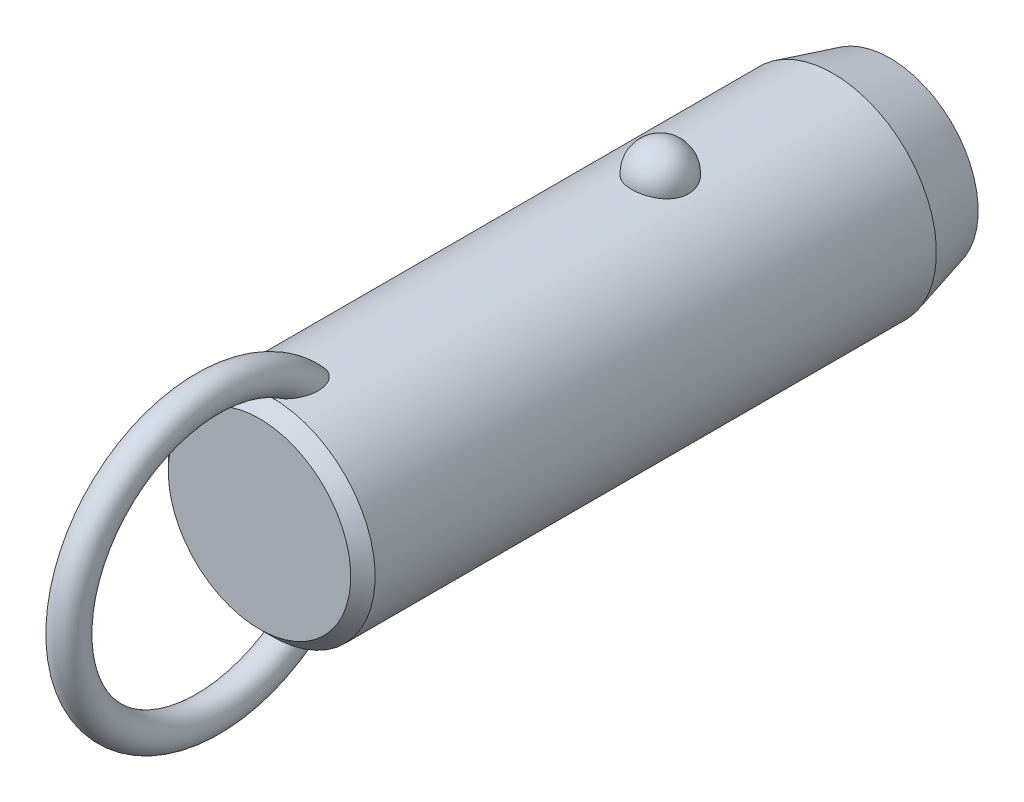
ISO-10303-21;
HEADER;
FILE_DESCRIPTION(('STEP AP214'),'2;1');
FILE_NAME('part.step','',(''),(''),'','','');
FILE_SCHEMA(('AUTOMOTIVE_DESIGN { 1 0 10303 214 1 1 1 1 }'));
ENDSEC;
DATA;
#1=APPLICATION_CONTEXT('core data for automotive mechanical design processes');
#2=APPLICATION_PROTOCOL_DEFINITION('international standard','automotive_design',2000,#1);
#3=PRODUCT_CONTEXT('',#1,'mechanical');
#4=PRODUCT('Part','Part','',(#3));
#5=PRODUCT_RELATED_PRODUCT_CATEGORY('part','',(#4));
#6=PRODUCT_DEFINITION_FORMATION('','',#4);
#7=PRODUCT_DEFINITION_CONTEXT('part definition',#1,'design');
#8=PRODUCT_DEFINITION('design','',#6,#7);
#9=PRODUCT_DEFINITION_SHAPE('','',#8);
#10=(LENGTH_UNIT() NAMED_UNIT(*) SI_UNIT(.MILLI.,.METRE.));
#11=(NAMED_UNIT(*) PLANE_ANGLE_UNIT() SI_UNIT($,.RADIAN.));
#12=(NAMED_UNIT(*) SI_UNIT($,.STERADIAN.) SOLID_ANGLE_UNIT());
#13=UNCERTAINTY_MEASURE_WITH_UNIT(LENGTH_MEASURE(1.E-05),#10,'distance_accuracy_value','');
#14=(GEOMETRIC_REPRESENTATION_CONTEXT(3) GLOBAL_UNCERTAINTY_ASSIGNED_CONTEXT((#13)) GLOBAL_UNIT_ASSIGNED_CONTEXT((#10,
#11,#12)) REPRESENTATION_CONTEXT('',''));
#15=CARTESIAN_POINT('',(0.,0.,0.));
#16=DIRECTION('',(0.,0.,1.));
#17=DIRECTION('',(1.,0.,0.));
#18=AXIS2_PLACEMENT_3D('',#15,#16,#17);
#19=CARTESIAN_POINT('',(0.,0.,33.));
#20=DIRECTION('',(0.,0.,-1.));
#21=DIRECTION('',(-1.,0.,0.));
#22=AXIS2_PLACEMENT_3D('',#19,#20,#21);
#23=CYLINDRICAL_SURFACE('',#22,12.7);
#24=CARTESIAN_POINT('',(3.46661256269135,12.2177165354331,-3.5));
#25=CARTESIAN_POINT('',(3.4666090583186,12.2177194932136,-3.30432790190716));
#26=CARTESIAN_POINT('',(3.45063567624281,12.2222841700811,-3.10861112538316));
#27=CARTESIAN_POINT('',(3.38712451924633,12.2400345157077,-2.72271899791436));
#28=CARTESIAN_POINT('',(3.33957415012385,12.2532236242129,-2.53254588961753));
#29=CARTESIAN_POINT('',(3.2141234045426,12.286724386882,-2.16324948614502));
#30=CARTESIAN_POINT('',(3.13623639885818,12.3070329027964,-1.98412136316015));
#31=CARTESIAN_POINT('',(2.95205930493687,12.3525018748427,-1.64180592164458));
#32=CARTESIAN_POINT('',(2.84577003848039,12.3776621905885,-1.47861814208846));
#33=CARTESIAN_POINT('',(2.60688050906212,12.4301712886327,-1.17190583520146));
#34=CARTESIAN_POINT('',(2.47415697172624,12.4575299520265,-1.02847897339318));
#35=CARTESIAN_POINT('',(2.18615174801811,12.5112810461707,-0.76617774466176));
#36=CARTESIAN_POINT('',(2.03087002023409,12.5376734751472,-0.647303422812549));
#37=CARTESIAN_POINT('',(1.70237334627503,12.5864761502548,-0.437732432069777));
#38=CARTESIAN_POINT('',(1.52920948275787,12.6088972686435,-0.346958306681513));
#39=CARTESIAN_POINT('',(1.16944170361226,12.6473352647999,-0.195750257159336));
#40=CARTESIAN_POINT('',(0.982839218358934,12.663352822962,-0.13531310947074));
#41=CARTESIAN_POINT('',(0.604961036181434,12.6869706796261,-0.0473241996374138));
#42=CARTESIAN_POINT('',(0.41382314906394,12.6947125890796,-0.0192185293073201));
#43=CARTESIAN_POINT('',(0.0293827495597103,12.7014203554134,0.00517254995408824));
#44=CARTESIAN_POINT('',(-0.163919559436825,12.7003870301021,0.00146092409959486));
#45=CARTESIAN_POINT('',(-0.544374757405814,12.689735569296,-0.037393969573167));
#46=CARTESIAN_POINT('',(-0.731575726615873,12.6802364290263,-0.072101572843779));
#47=CARTESIAN_POINT('',(-1.09733277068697,12.6538333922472,-0.171364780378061));
#48=CARTESIAN_POINT('',(-1.27588869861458,12.6369293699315,-0.235920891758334));
#49=CARTESIAN_POINT('',(-1.6204698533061,12.5973946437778,-0.393548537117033));
#50=CARTESIAN_POINT('',(-1.78641865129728,12.5747321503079,-0.486778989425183));
#51=CARTESIAN_POINT('',(-2.10030671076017,12.5261316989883,-0.699110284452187));
#52=CARTESIAN_POINT('',(-2.24824419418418,12.5001934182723,-0.818213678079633));
#53=CARTESIAN_POINT('',(-2.52491489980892,12.4472906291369,-1.08157124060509));
#54=CARTESIAN_POINT('',(-2.65324222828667,12.4203160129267,-1.22624992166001));
#55=CARTESIAN_POINT('',(-2.88410007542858,12.3687509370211,-1.53528325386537));
#56=CARTESIAN_POINT('',(-2.98662883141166,12.3441606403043,-1.69963924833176));
#57=CARTESIAN_POINT('',(-3.16432417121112,12.2998199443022,-2.04548497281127));
#58=CARTESIAN_POINT('',(-3.23917525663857,12.2801261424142,-2.22714424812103));
#59=CARTESIAN_POINT('',(-3.35800573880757,12.248167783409,-2.6009138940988));
#60=CARTESIAN_POINT('',(-3.4019860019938,12.2359030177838,-2.79302397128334));
#61=CARTESIAN_POINT('',(-3.45784812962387,12.2202347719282,-3.18140279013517));
#62=CARTESIAN_POINT('',(-3.46986123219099,12.2167950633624,-3.37765118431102));
#63=CARTESIAN_POINT('',(-3.46186273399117,12.2190638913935,-3.76943689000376));
#64=CARTESIAN_POINT('',(-3.44185196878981,12.2247721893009,-3.96497421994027));
#65=CARTESIAN_POINT('',(-3.37048652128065,12.2446381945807,-4.34881728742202));
#66=CARTESIAN_POINT('',(-3.31928253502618,12.2587552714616,-4.53715319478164));
#67=CARTESIAN_POINT('',(-3.18693461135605,12.2938237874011,-4.90231727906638));
#68=CARTESIAN_POINT('',(-3.1057895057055,12.3147754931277,-5.07914500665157));
#69=CARTESIAN_POINT('',(-2.91506431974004,12.3613125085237,-5.41732059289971));
#70=CARTESIAN_POINT('',(-2.80533587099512,12.3869217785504,-5.57858147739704));
#71=CARTESIAN_POINT('',(-2.560414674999,12.4398525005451,-5.88013283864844));
#72=CARTESIAN_POINT('',(-2.42522099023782,12.4671740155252,-6.02042254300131));
#73=CARTESIAN_POINT('',(-2.1323357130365,12.5205965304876,-6.27662798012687));
#74=CARTESIAN_POINT('',(-1.97456596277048,12.5466928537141,-6.3924554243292));
#75=CARTESIAN_POINT('',(-1.64115839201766,12.5946384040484,-6.59583547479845));
#76=CARTESIAN_POINT('',(-1.46552179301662,12.6164879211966,-6.68339001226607));
#77=CARTESIAN_POINT('',(-1.10356050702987,12.6532533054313,-6.82682153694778));
#78=CARTESIAN_POINT('',(-0.9173913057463,12.6682500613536,-6.8830698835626));
#79=CARTESIAN_POINT('',(-0.537836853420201,12.6900288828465,-6.96386887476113));
#80=CARTESIAN_POINT('',(-0.344452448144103,12.6968119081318,-6.9884232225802));
#81=CARTESIAN_POINT('',(0.0402577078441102,12.7013667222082,-7.00496469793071));
#82=CARTESIAN_POINT('',(0.231556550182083,12.6993008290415,-6.99753844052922));
#83=CARTESIAN_POINT('',(0.610105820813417,12.6867505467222,-6.9516636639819));
#84=CARTESIAN_POINT('',(0.797356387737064,12.6762664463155,-6.91321620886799));
#85=CARTESIAN_POINT('',(1.16186657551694,12.6480587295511,-6.80658431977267));
#86=CARTESIAN_POINT('',(1.33915951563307,12.6303611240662,-6.73850666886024));
#87=CARTESIAN_POINT('',(1.67968518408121,12.5896027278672,-6.57450875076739));
#88=CARTESIAN_POINT('',(1.84291705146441,12.5665416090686,-6.47858678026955));
#89=CARTESIAN_POINT('',(2.15340192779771,12.5171072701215,-6.25982455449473));
#90=CARTESIAN_POINT('',(2.30037831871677,12.4906895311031,-6.13660186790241));
#91=CARTESIAN_POINT('',(2.5717412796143,12.4376567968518,-5.86739587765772));
#92=CARTESIAN_POINT('',(2.69612388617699,12.4110417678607,-5.72140858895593));
#93=CARTESIAN_POINT('',(2.92107785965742,12.360051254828,-5.40794137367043));
#94=CARTESIAN_POINT('',(3.02121329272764,12.3357209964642,-5.24014110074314));
#95=CARTESIAN_POINT('',(3.19236291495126,12.2925446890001,-4.8896986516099));
#96=CARTESIAN_POINT('',(3.26338839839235,12.2736965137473,-4.70706226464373));
#97=CARTESIAN_POINT('',(3.36788038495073,12.245404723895,-4.35469510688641));
#98=CARTESIAN_POINT('',(3.40484026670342,12.2351018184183,-4.18605935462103));
#99=CARTESIAN_POINT('',(3.45420764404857,12.2212564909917,-3.84496058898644));
#100=CARTESIAN_POINT('',(3.46661565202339,12.2177139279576,-3.67249765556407));
#101=CARTESIAN_POINT('',(3.46661256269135,12.2177165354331,-3.5));
#102=B_SPLINE_CURVE_WITH_KNOTS('',3,(#24,#25,#26,#27,#28,#29,#30,#31,#32,#33,#34,#35,#36,#37,
#38,#39,#40,#41,#42,#43,#44,#45,#46,#47,#48,#49,#50,#51,#52,#53,#54,#55,#56,#57,#58,#59,#60,#61,
#62,#63,#64,#65,#66,#67,#68,#69,#70,#71,#72,#73,#74,#75,#76,#77,#78,#79,#80,#81,#82,#83,#84,#85,
#86,#87,#88,#89,#90,#91,#92,#93,#94,#95,#96,#97,#98,#99,#100,#101),.UNSPECIFIED.,.T.,.F.,(4,2,2,
2,2,2,2,2,2,2,2,2,2,2,2,2,2,2,2,2,2,2,2,2,2,2,2,2,2,2,2,2,2,2,2,2,2,2,4),(0.,0.586396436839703,
1.17302689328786,1.7593990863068,2.34575431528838,2.93491084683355,3.52406845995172,
4.11158733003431,4.69904375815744,5.2762784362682,5.85345931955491,6.42265312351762,
6.99185659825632,7.56427334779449,8.136746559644,8.71981013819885,9.3029135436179,
9.89247258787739,10.4820150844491,11.0691335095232,11.6562366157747,12.2405256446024,
12.8248374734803,13.412244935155,13.9996740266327,14.5891883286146,15.1786623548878,
15.7609861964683,16.3432419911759,16.9148635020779,17.4864654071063,18.0560241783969,
18.6256177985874,19.2037609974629,19.7820055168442,20.3699810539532,20.957728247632,
21.4746855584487,21.9916320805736),.UNSPECIFIED.);
#103=CARTESIAN_POINT('',(3.46661256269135,12.2177165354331,-3.5));
#104=VERTEX_POINT('',#103);
#105=EDGE_CURVE('E41',#104,#104,#102,.T.);
#106=ORIENTED_EDGE('',*,*,#105,.T.);
#107=EDGE_LOOP('',(#106));
#108=FACE_BOUND('',#107,.T.);
#109=CARTESIAN_POINT('',(0.,0.,44.2));
#110=DIRECTION('',(0.,0.,1.));
#111=DIRECTION('',(1.,0.,0.));
#112=AXIS2_PLACEMENT_3D('',#109,#110,#111);
#113=CIRCLE('',#112,12.7);
#114=CARTESIAN_POINT('',(-12.7,0.,44.2));
#115=VERTEX_POINT('',#114);
#116=EDGE_CURVE('E10',#115,#115,#113,.F.);
#117=ORIENTED_EDGE('',*,*,#116,.T.);
#118=EDGE_LOOP('',(#117));
#119=FACE_BOUND('',#118,.T.);
#120=CARTESIAN_POINT('',(-0.54812224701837,-12.6881662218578,37.9432187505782));
#121=CARTESIAN_POINT('',(-0.648865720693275,-12.6838128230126,37.977926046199));
#122=CARTESIAN_POINT('',(-0.746398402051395,-12.6783867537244,38.0220428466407));
#123=CARTESIAN_POINT('',(-0.932125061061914,-12.666091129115,38.1267647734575));
#124=CARTESIAN_POINT('',(-1.02030388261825,-12.6592192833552,38.1873961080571));
#125=CARTESIAN_POINT('',(-1.18487740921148,-12.6448747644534,38.321847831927));
#126=CARTESIAN_POINT('',(-1.26134296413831,-12.637406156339,38.3955825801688));
#127=CARTESIAN_POINT('',(-1.4023120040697,-12.6225412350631,38.5536045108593));
#128=CARTESIAN_POINT('',(-1.46681470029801,-12.6151449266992,38.6378923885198));
#129=CARTESIAN_POINT('',(-1.60714786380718,-12.5981718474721,38.8496577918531));
#130=CARTESIAN_POINT('',(-1.67725126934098,-12.588900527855,38.980962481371));
#131=CARTESIAN_POINT('',(-1.79536591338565,-12.5725964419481,39.2532471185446));
#132=CARTESIAN_POINT('',(-1.84333535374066,-12.5655679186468,39.3942447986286));
#133=CARTESIAN_POINT('',(-1.93422576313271,-12.5519624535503,39.7376455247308));
#134=CARTESIAN_POINT('',(-1.96788773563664,-12.5466298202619,39.9425578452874));
#135=CARTESIAN_POINT('',(-1.9941399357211,-12.542463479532,40.2517600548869));
#136=CARTESIAN_POINT('',(-1.99883864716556,-12.5417153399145,40.3552987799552));
#137=CARTESIAN_POINT('',(-2.00078003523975,-12.5414074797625,40.5624512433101));
#138=CARTESIAN_POINT('',(-1.99802449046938,-12.5418474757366,40.6660649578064));
#139=CARTESIAN_POINT('',(-1.98336733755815,-12.5441750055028,40.9103207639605));
#140=CARTESIAN_POINT('',(-1.96851430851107,-12.5465291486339,41.050780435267));
#141=CARTESIAN_POINT('',(-1.92707089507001,-12.5529612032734,41.3299607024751));
#142=CARTESIAN_POINT('',(-1.900474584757,-12.5570399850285,41.4686803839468));
#143=CARTESIAN_POINT('',(-1.83619120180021,-12.5666008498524,41.7434113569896));
#144=CARTESIAN_POINT('',(-1.79850828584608,-12.57208240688,41.8794236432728));
#145=CARTESIAN_POINT('',(-1.71223796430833,-12.5841228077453,42.1478421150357));
#146=CARTESIAN_POINT('',(-1.66365679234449,-12.5906810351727,42.2802503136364));
#147=CARTESIAN_POINT('',(-1.57804503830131,-12.6016176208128,42.4854887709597));
#148=CARTESIAN_POINT('',(-1.54477252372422,-12.6057501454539,42.5599149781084));
#149=CARTESIAN_POINT('',(-1.47424480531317,-12.6141930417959,42.7068393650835));
#150=CARTESIAN_POINT('',(-1.43699041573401,-12.6185033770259,42.7793379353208));
#151=CARTESIAN_POINT('',(-1.35825795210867,-12.6272207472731,42.9218926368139));
#152=CARTESIAN_POINT('',(-1.31678520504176,-12.6316276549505,42.9919517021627));
#153=CARTESIAN_POINT('',(-1.22917793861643,-12.6404532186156,43.1290705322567));
#154=CARTESIAN_POINT('',(-1.18304514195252,-12.6448718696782,43.1961313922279));
#155=CARTESIAN_POINT('',(-1.07246411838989,-12.6547893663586,43.3438741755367));
#156=CARTESIAN_POINT('',(-1.00642239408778,-12.6602600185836,43.4233844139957));
#157=CARTESIAN_POINT('',(-0.864441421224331,-12.6707460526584,43.5731698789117));
#158=CARTESIAN_POINT('',(-0.788516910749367,-12.6757620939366,43.6434585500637));
#159=CARTESIAN_POINT('',(-0.652215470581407,-12.6833591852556,43.7486801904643));
#160=CARTESIAN_POINT('',(-0.594982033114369,-12.6861973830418,43.7876241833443));
#161=CARTESIAN_POINT('',(-0.475269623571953,-12.6912445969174,43.8564899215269));
#162=CARTESIAN_POINT('',(-0.412800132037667,-12.6934547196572,43.8864275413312));
#163=CARTESIAN_POINT('',(-0.295749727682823,-12.6966636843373,43.9297565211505));
#164=CARTESIAN_POINT('',(-0.241949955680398,-12.6978134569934,43.9452188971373));
#165=CARTESIAN_POINT('',(-0.132508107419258,-12.6994261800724,43.9668845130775));
#166=CARTESIAN_POINT('',(-0.0768679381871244,-12.6998898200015,43.9730970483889));
#167=CARTESIAN_POINT('',(0.0347696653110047,-12.7000752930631,43.9755838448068));
#168=CARTESIAN_POINT('',(0.0907676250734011,-12.6997954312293,43.9718353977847));
#169=CARTESIAN_POINT('',(0.201283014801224,-12.6985255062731,43.9547883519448));
#170=CARTESIAN_POINT('',(0.255799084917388,-12.6975348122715,43.9414812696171));
#171=CARTESIAN_POINT('',(0.376042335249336,-12.6946091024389,43.9020379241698));
#172=CARTESIAN_POINT('',(0.440950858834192,-12.6924943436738,43.8734492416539));
#173=CARTESIAN_POINT('',(0.565350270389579,-12.6875639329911,43.8063234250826));
#174=CARTESIAN_POINT('',(0.624828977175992,-12.6847467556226,43.7677646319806));
#175=CARTESIAN_POINT('',(0.774116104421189,-12.6767252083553,43.656949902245));
#176=CARTESIAN_POINT('',(0.859449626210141,-12.6711344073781,43.5787605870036));
#177=CARTESIAN_POINT('',(1.01789440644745,-12.6593922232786,43.410943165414));
#178=CARTESIAN_POINT('',(1.09096902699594,-12.653239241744,43.321282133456));
#179=CARTESIAN_POINT('',(1.22268793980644,-12.6411674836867,43.1402658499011));
#180=CARTESIAN_POINT('',(1.28193986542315,-12.6352572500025,43.049345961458));
#181=CARTESIAN_POINT('',(1.39259777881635,-12.6235401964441,42.8627929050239));
#182=CARTESIAN_POINT('',(1.44399707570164,-12.6177334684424,42.7671558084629));
#183=CARTESIAN_POINT('',(1.53972870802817,-12.6064093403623,42.5722738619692));
#184=CARTESIAN_POINT('',(1.58405262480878,-12.6008922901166,42.4730248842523));
#185=CARTESIAN_POINT('',(1.66600705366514,-12.5903187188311,42.2717727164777));
#186=CARTESIAN_POINT('',(1.70363651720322,-12.5852622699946,42.1697690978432));
#187=CARTESIAN_POINT('',(1.7754537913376,-12.5753406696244,41.9543580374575));
#188=CARTESIAN_POINT('',(1.80903453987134,-12.5705328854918,41.8407454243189));
#189=CARTESIAN_POINT('',(1.86844163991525,-12.5618400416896,41.6114575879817));
#190=CARTESIAN_POINT('',(1.89426665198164,-12.5579551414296,41.4957820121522));
#191=CARTESIAN_POINT('',(1.93785464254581,-12.5513030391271,41.2630072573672));
#192=CARTESIAN_POINT('',(1.95562640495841,-12.5485346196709,41.1459097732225));
#193=CARTESIAN_POINT('',(1.98264463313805,-12.5442934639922,40.9107473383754));
#194=CARTESIAN_POINT('',(1.99189298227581,-12.5428204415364,40.7926826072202));
#195=CARTESIAN_POINT('',(2.00416068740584,-12.540871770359,40.4806225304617));
#196=CARTESIAN_POINT('',(1.99944433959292,-12.541631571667,40.286229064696));
#197=CARTESIAN_POINT('',(1.96113755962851,-12.5476846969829,39.9003095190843));
#198=CARTESIAN_POINT('',(1.92758341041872,-12.5529723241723,39.7087801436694));
#199=CARTESIAN_POINT('',(1.83934342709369,-12.5661532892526,39.3822728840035));
#200=CARTESIAN_POINT('',(1.79215440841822,-12.5730485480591,39.2452499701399));
#201=CARTESIAN_POINT('',(1.67676242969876,-12.588958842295,38.9804459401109));
#202=CARTESIAN_POINT('',(1.60859050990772,-12.597970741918,38.8526515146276));
#203=CARTESIAN_POINT('',(1.4658383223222,-12.6152829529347,38.6358006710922));
#204=CARTESIAN_POINT('',(1.39525727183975,-12.6233659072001,38.5441050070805));
#205=CARTESIAN_POINT('',(1.2399259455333,-12.6395676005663,38.3734854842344));
#206=CARTESIAN_POINT('',(1.15517932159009,-12.6476863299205,38.2945583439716));
#207=CARTESIAN_POINT('',(0.971995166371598,-12.6630846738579,38.1526438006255));
#208=CARTESIAN_POINT('',(0.873456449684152,-12.6703572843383,38.089784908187));
#209=CARTESIAN_POINT('',(0.665847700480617,-12.6829569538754,37.9844870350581));
#210=CARTESIAN_POINT('',(0.55678457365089,-12.688285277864,37.9420347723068));
#211=CARTESIAN_POINT('',(0.347338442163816,-12.6956226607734,37.8844434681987));
#212=CARTESIAN_POINT('',(0.247759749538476,-12.6979816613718,37.8663996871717));
#213=CARTESIAN_POINT('',(0.0470218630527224,-12.7003077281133,37.8486007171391));
#214=CARTESIAN_POINT('',(-0.0541350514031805,-12.7002779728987,37.8488212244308));
#215=CARTESIAN_POINT('',(-0.221414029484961,-12.6982482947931,37.8643639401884));
#216=CARTESIAN_POINT('',(-0.288055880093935,-12.6969033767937,37.8746662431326));
#217=CARTESIAN_POINT('',(-0.419599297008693,-12.6932369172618,37.9031348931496));
#218=CARTESIAN_POINT('',(-0.484501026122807,-12.6909154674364,37.9213005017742));
#219=CARTESIAN_POINT('',(-0.54812224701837,-12.6881662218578,37.9432187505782));
#220=B_SPLINE_CURVE_WITH_KNOTS('',3,(#120,#121,#122,#123,#124,#125,#126,#127,#128,#129,#130,
#131,#132,#133,#134,#135,#136,#137,#138,#139,#140,#141,#142,#143,#144,#145,#146,#147,#148,#149,
#150,#151,#152,#153,#154,#155,#156,#157,#158,#159,#160,#161,#162,#163,#164,#165,#166,#167,#168,
#169,#170,#171,#172,#173,#174,#175,#176,#177,#178,#179,#180,#181,#182,#183,#184,#185,#186,#187,
#188,#189,#190,#191,#192,#193,#194,#195,#196,#197,#198,#199,#200,#201,#202,#203,#204,#205,#206,
#207,#208,#209,#210,#211,#212,#213,#214,#215,#216,#217,#218,#219),.UNSPECIFIED.,.T.,.F.,(4,2,2,
2,2,2,2,2,2,2,2,2,2,2,2,2,2,2,2,2,2,2,2,2,2,2,2,2,2,2,2,2,2,2,2,2,2,2,2,2,2,2,2,2,2,2,2,2,2,4),
(0.,0.319642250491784,0.639794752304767,0.957927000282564,1.27608021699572,1.72100165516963,
2.16675988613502,2.78630021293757,3.09705782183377,3.40774128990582,3.83096358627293,
4.25439969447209,4.67767724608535,5.10071330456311,5.34550297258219,5.59024267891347,
5.8346770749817,6.07902143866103,6.38891080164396,6.69834321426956,6.90560910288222,
7.11250749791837,7.27977315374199,7.44687060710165,7.6143493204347,7.78197685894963,
7.99365544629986,8.20579780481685,8.551473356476,8.89816429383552,9.22375138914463,
9.54961437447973,9.87586224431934,10.202161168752,10.5575872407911,10.9130746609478,
11.2681734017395,11.6231936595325,12.2046601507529,12.7853961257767,13.219164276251,
13.6522938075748,13.9989174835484,14.3454519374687,14.6946768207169,15.0436740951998,
15.3457513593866,15.6474266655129,15.8493051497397,16.0511646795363),.UNSPECIFIED.);
#221=CARTESIAN_POINT('',(-0.54812224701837,-12.6881662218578,37.9432187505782));
#222=VERTEX_POINT('',#221);
#223=EDGE_CURVE('E59',#222,#222,#220,.T.);
#224=ORIENTED_EDGE('',*,*,#223,.T.);
#225=EDGE_LOOP('',(#224));
#226=FACE_BOUND('',#225,.T.);
#227=CARTESIAN_POINT('',(-0.54812224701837,12.6881662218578,37.9432187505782));
#228=CARTESIAN_POINT('',(-0.459436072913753,12.6919968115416,37.912673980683));
#229=CARTESIAN_POINT('',(-0.368189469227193,12.6949996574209,37.8893913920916));
#230=CARTESIAN_POINT('',(-0.183024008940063,12.6990186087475,37.8584062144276));
#231=CARTESIAN_POINT('',(-0.0891049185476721,12.7000345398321,37.8507049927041));
#232=CARTESIAN_POINT('',(0.098714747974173,12.6999636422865,37.8512455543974));
#233=CARTESIAN_POINT('',(0.192615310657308,12.6988761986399,37.8594920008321));
#234=CARTESIAN_POINT('',(0.377658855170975,12.6947211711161,37.8915515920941));
#235=CARTESIAN_POINT('',(0.468801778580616,12.6916535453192,37.9153650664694));
#236=CARTESIAN_POINT('',(0.645809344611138,12.6838788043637,37.9774565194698));
#237=CARTESIAN_POINT('',(0.731679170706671,12.6791733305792,38.015720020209));
#238=CARTESIAN_POINT('',(0.896315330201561,12.6686004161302,38.105120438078));
#239=CARTESIAN_POINT('',(0.975080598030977,12.6627328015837,38.1562592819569));
#240=CARTESIAN_POINT('',(1.12963655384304,12.6499161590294,38.2736782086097));
#241=CARTESIAN_POINT('',(1.20478673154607,12.6429194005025,38.3407929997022));
#242=CARTESIAN_POINT('',(1.34448241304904,12.6288282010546,38.4852250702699));
#243=CARTESIAN_POINT('',(1.40902173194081,12.621733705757,38.5625482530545));
#244=CARTESIAN_POINT('',(1.55208211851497,12.6050877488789,38.7592475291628));
#245=CARTESIAN_POINT('',(1.62510490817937,12.5957546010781,38.8826540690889));
#246=CARTESIAN_POINT('',(1.7501904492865,12.5789823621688,39.1397690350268));
#247=CARTESIAN_POINT('',(1.80221377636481,12.5715468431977,39.273496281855));
#248=CARTESIAN_POINT('',(1.90309965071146,12.5567434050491,39.5983516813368));
#249=CARTESIAN_POINT('',(1.94342317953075,12.5504515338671,39.7921611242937));
#250=CARTESIAN_POINT('',(1.99332997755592,12.5426147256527,40.1837881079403));
#251=CARTESIAN_POINT('',(2.00285305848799,12.5410790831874,40.3816127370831));
#252=CARTESIAN_POINT('',(1.99678999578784,12.5420407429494,40.7166427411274));
#253=CARTESIAN_POINT('',(1.98794117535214,12.5434564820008,40.8540428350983));
#254=CARTESIAN_POINT('',(1.95865119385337,12.5480641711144,41.1276394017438));
#255=CARTESIAN_POINT('',(1.9382043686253,12.5512569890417,41.2638352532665));
#256=CARTESIAN_POINT('',(1.88647896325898,12.5591352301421,41.5342493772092));
#257=CARTESIAN_POINT('',(1.85518800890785,12.5638223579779,41.6684652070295));
#258=CARTESIAN_POINT('',(1.78217886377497,12.5743868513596,41.9339362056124));
#259=CARTESIAN_POINT('',(1.74046509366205,12.5802637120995,42.0651926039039));
#260=CARTESIAN_POINT('',(1.66024095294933,12.5910571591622,42.2860855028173));
#261=CARTESIAN_POINT('',(1.62434772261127,12.5957535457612,42.3766904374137));
#262=CARTESIAN_POINT('',(1.5470900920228,12.6054762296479,42.5555125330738));
#263=CARTESIAN_POINT('',(1.50572681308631,12.6105024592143,42.6437301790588));
#264=CARTESIAN_POINT('',(1.41728020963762,12.620748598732,42.8169321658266));
#265=CARTESIAN_POINT('',(1.37021377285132,12.625967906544,42.9019251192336));
#266=CARTESIAN_POINT('',(1.2696962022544,12.6364721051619,43.0680072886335));
#267=CARTESIAN_POINT('',(1.21624929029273,12.6417569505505,43.1490990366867));
#268=CARTESIAN_POINT('',(1.10304413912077,12.6521331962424,43.3047027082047));
#269=CARTESIAN_POINT('',(1.04340936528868,12.657226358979,43.3793033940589));
#270=CARTESIAN_POINT('',(0.915919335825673,12.6670906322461,43.521324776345));
#271=CARTESIAN_POINT('',(0.848064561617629,12.6718617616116,43.5887458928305));
#272=CARTESIAN_POINT('',(0.717035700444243,12.67987711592,43.7006247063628));
#273=CARTESIAN_POINT('',(0.655526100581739,12.6832377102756,43.7469970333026));
#274=CARTESIAN_POINT('',(0.525985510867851,12.6892676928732,43.8296195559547));
#275=CARTESIAN_POINT('',(0.457969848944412,12.6919386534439,43.8658927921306));
#276=CARTESIAN_POINT('',(0.33485964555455,12.695691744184,43.9166572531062));
#277=CARTESIAN_POINT('',(0.281116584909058,12.6970073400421,43.9343733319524));
#278=CARTESIAN_POINT('',(0.171425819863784,12.6989609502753,43.9606429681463));
#279=CARTESIAN_POINT('',(0.115480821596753,12.699599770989,43.9692074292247));
#280=CARTESIAN_POINT('',(0.0027261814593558,12.7001251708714,43.9762531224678));
#281=CARTESIAN_POINT('',(-0.054085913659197,12.7000089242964,43.9746964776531));
#282=CARTESIAN_POINT('',(-0.166544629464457,12.6990328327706,43.9616005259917));
#283=CARTESIAN_POINT('',(-0.22219029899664,12.6981724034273,43.9500533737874));
#284=CARTESIAN_POINT('',(-0.342018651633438,12.695562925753,43.9149128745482));
#285=CARTESIAN_POINT('',(-0.405606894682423,12.6936676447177,43.8893322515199));
#286=CARTESIAN_POINT('',(-0.527815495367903,12.6891754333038,43.8283111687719));
#287=CARTESIAN_POINT('',(-0.586425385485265,12.6865770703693,43.7928505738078));
#288=CARTESIAN_POINT('',(-0.731842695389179,12.6792129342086,43.6914960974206));
#289=CARTESIAN_POINT('',(-0.814709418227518,12.6740767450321,43.6200395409));
#290=CARTESIAN_POINT('',(-0.96910175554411,12.6632083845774,43.4658900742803));
#291=CARTESIAN_POINT('',(-1.04059564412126,12.6574746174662,43.3831668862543));
#292=CARTESIAN_POINT('',(-1.1698111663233,12.6461638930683,43.2158096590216));
#293=CARTESIAN_POINT('',(-1.2281136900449,12.6405994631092,43.1316166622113));
#294=CARTESIAN_POINT('',(-1.33743405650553,12.6295007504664,42.9585791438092));
#295=CARTESIAN_POINT('',(-1.38844577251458,12.6239664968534,42.8697307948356));
#296=CARTESIAN_POINT('',(-1.48400702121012,12.6130898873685,42.6883895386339));
#297=CARTESIAN_POINT('',(-1.52854232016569,12.6077479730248,42.5958891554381));
#298=CARTESIAN_POINT('',(-1.61150113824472,12.5974127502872,42.4081607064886));
#299=CARTESIAN_POINT('',(-1.64992317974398,12.5924195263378,42.3129319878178));
#300=CARTESIAN_POINT('',(-1.73468589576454,12.581070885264,42.0828936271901));
#301=CARTESIAN_POINT('',(-1.77831261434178,12.5749388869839,41.9470661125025));
#302=CARTESIAN_POINT('',(-1.85439734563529,12.5639437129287,41.6722128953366));
#303=CARTESIAN_POINT('',(-1.88684994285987,12.5590811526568,41.5331856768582));
#304=CARTESIAN_POINT('',(-1.9400848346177,12.550968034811,41.2530923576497));
#305=CARTESIAN_POINT('',(-1.96088706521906,12.5477147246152,41.1120301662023));
#306=CARTESIAN_POINT('',(-1.99000539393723,12.5431291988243,40.8286689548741));
#307=CARTESIAN_POINT('',(-1.99832911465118,12.5417958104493,40.6863707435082));
#308=CARTESIAN_POINT('',(-2.00166624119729,12.5412674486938,40.3576271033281));
#309=CARTESIAN_POINT('',(-1.99178843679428,12.5428579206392,40.171088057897));
#310=CARTESIAN_POINT('',(-1.94455183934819,12.5502731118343,39.8016240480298));
#311=CARTESIAN_POINT('',(-1.90724032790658,12.5560905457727,39.6186934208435));
#312=CARTESIAN_POINT('',(-1.81330718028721,12.5699462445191,39.3048488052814));
#313=CARTESIAN_POINT('',(-1.76338820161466,12.5771273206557,39.1719105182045));
#314=CARTESIAN_POINT('',(-1.6430501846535,12.593414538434,38.9156813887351));
#315=CARTESIAN_POINT('',(-1.57265346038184,12.6025185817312,38.792380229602));
#316=CARTESIAN_POINT('',(-1.42634956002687,12.6198178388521,38.5835648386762));
#317=CARTESIAN_POINT('',(-1.35423772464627,12.6278405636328,38.4953846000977));
#318=CARTESIAN_POINT('',(-1.19645664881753,12.6437632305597,38.3321079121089));
#319=CARTESIAN_POINT('',(-1.11080536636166,12.6516633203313,38.2569944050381));
#320=CARTESIAN_POINT('',(-0.947219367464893,12.6648319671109,38.1378114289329));
#321=CARTESIAN_POINT('',(-0.871624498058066,12.670300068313,38.0905414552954));
#322=CARTESIAN_POINT('',(-0.71416188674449,12.6801492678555,38.0077413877));
#323=CARTESIAN_POINT('',(-0.6322953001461,12.684530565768,37.9722091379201));
#324=CARTESIAN_POINT('',(-0.54812224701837,12.6881662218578,37.9432187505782));
#325=B_SPLINE_CURVE_WITH_KNOTS('',3,(#227,#228,#229,#230,#231,#232,#233,#234,#235,#236,#237,
#238,#239,#240,#241,#242,#243,#244,#245,#246,#247,#248,#249,#250,#251,#252,#253,#254,#255,#256,
#257,#258,#259,#260,#261,#262,#263,#264,#265,#266,#267,#268,#269,#270,#271,#272,#273,#274,#275,
#276,#277,#278,#279,#280,#281,#282,#283,#284,#285,#286,#287,#288,#289,#290,#291,#292,#293,#294,
#295,#296,#297,#298,#299,#300,#301,#302,#303,#304,#305,#306,#307,#308,#309,#310,#311,#312,#313,
#314,#315,#316,#317,#318,#319,#320,#321,#322,#323,#324),.UNSPECIFIED.,.T.,.F.,(4,2,2,2,2,2,2,2,
2,2,2,2,2,2,2,2,2,2,2,2,2,2,2,2,2,2,2,2,2,2,2,2,2,2,2,2,2,2,2,2,2,2,2,2,2,2,2,2,4),(0.,
0.281328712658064,0.562682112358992,0.844117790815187,1.12555942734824,1.40671982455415,
1.68792232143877,1.98972294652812,2.2916988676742,2.72039860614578,3.14989948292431,
3.7408491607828,4.33295293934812,4.74554109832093,5.15833092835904,5.57159335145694,
5.98468079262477,6.27722775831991,6.56971484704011,6.86135609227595,7.1528054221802,
7.43927407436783,7.72572595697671,7.9563586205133,8.18646071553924,8.35559393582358,
8.52452541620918,8.69408946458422,8.86378678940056,9.06834348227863,9.27332014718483,
9.60010414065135,9.9277843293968,10.2350252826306,10.5425229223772,10.8506864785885,
11.1589244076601,11.5867893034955,12.0148612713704,12.4421984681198,12.8692745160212,
13.4279365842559,13.9856380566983,14.4107062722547,14.8353130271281,15.1765567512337,
15.5173516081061,15.7844129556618,16.051425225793),.UNSPECIFIED.);
#326=CARTESIAN_POINT('',(-0.54812224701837,12.6881662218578,37.9432187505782));
#327=VERTEX_POINT('',#326);
#328=EDGE_CURVE('E67',#327,#327,#325,.T.);
#329=ORIENTED_EDGE('',*,*,#328,.T.);
#330=EDGE_LOOP('',(#329));
#331=FACE_BOUND('',#330,.T.);
#332=CARTESIAN_POINT('',(0.,0.,-24.6999999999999));
#333=DIRECTION('',(0.,0.,-1.));
#334=DIRECTION('',(-1.,0.,0.));
#335=AXIS2_PLACEMENT_3D('',#332,#333,#334);
#336=CIRCLE('',#335,12.7);
#337=CARTESIAN_POINT('',(-12.7,0.,-24.6999999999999));
#338=VERTEX_POINT('',#337);
#339=EDGE_CURVE('E56',#338,#338,#336,.F.);
#340=ORIENTED_EDGE('',*,*,#339,.T.);
#341=EDGE_LOOP('',(#340));
#342=FACE_BOUND('',#341,.T.);
#343=ADVANCED_FACE('F37',(#108,#119,#226,#331,#342),#23,.T.);
#344=CARTESIAN_POINT('',(0.,0.,-31.7));
#345=DIRECTION('',(0.,0.,-1.));
#346=DIRECTION('',(-1.,0.,0.));
#347=AXIS2_PLACEMENT_3D('',#344,#345,#346);
#348=PLANE('',#347);
#349=CARTESIAN_POINT('',(0.,0.,-31.7));
#350=DIRECTION('',(0.,0.,-1.));
#351=DIRECTION('',(-1.,0.,0.));
#352=AXIS2_PLACEMENT_3D('',#349,#350,#351);
#353=CIRCLE('',#352,10.8243556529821);
#354=CARTESIAN_POINT('',(-10.8243556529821,0.,-31.7));
#355=VERTEX_POINT('',#354);
#356=EDGE_CURVE('E66',#355,#355,#353,.T.);
#357=ORIENTED_EDGE('',*,*,#356,.T.);
#358=EDGE_LOOP('',(#357));
#359=FACE_BOUND('',#358,.T.);
#360=ADVANCED_FACE('F85',(#359),#348,.T.);
#361=CARTESIAN_POINT('',(0.,0.,-31.7));
#362=DIRECTION('',(0.,0.,1.));
#363=DIRECTION('',(1.,0.,0.));
#364=AXIS2_PLACEMENT_3D('',#361,#362,#363);
#365=CONICAL_SURFACE('',#364,10.8243556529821,0.261799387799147);
#366=ORIENTED_EDGE('',*,*,#339,.F.);
#367=EDGE_LOOP('',(#366));
#368=FACE_BOUND('',#367,.T.);
#369=ORIENTED_EDGE('',*,*,#356,.F.);
#370=EDGE_LOOP('',(#369));
#371=FACE_BOUND('',#370,.T.);
#372=ADVANCED_FACE('F83',(#368,#371),#365,.T.);
#373=CARTESIAN_POINT('',(0.,0.,45.7));
#374=DIRECTION('',(0.,0.,1.));
#375=DIRECTION('',(1.,0.,0.));
#376=AXIS2_PLACEMENT_3D('',#373,#374,#375);
#377=PLANE('',#376);
#378=CARTESIAN_POINT('',(0.,0.,45.7));
#379=DIRECTION('',(0.,0.,1.));
#380=DIRECTION('',(1.,0.,0.));
#381=AXIS2_PLACEMENT_3D('',#378,#379,#380);
#382=CIRCLE('',#381,11.2);
#383=CARTESIAN_POINT('',(-11.2,0.,45.7));
#384=VERTEX_POINT('',#383);
#385=EDGE_CURVE('E50',#384,#384,#382,.T.);
#386=ORIENTED_EDGE('',*,*,#385,.T.);
#387=EDGE_LOOP('',(#386));
#388=FACE_BOUND('',#387,.T.);
#389=ADVANCED_FACE('F77',(#388),#377,.T.);
#390=CARTESIAN_POINT('',(0.,0.,52.05));
#391=DIRECTION('',(1.,0.,0.));
#392=DIRECTION('',(0.,0.,-1.));
#393=AXIS2_PLACEMENT_3D('',#390,#391,#392);
#394=TOROIDAL_SURFACE('',#393,17.05,2.);
#395=ORIENTED_EDGE('',*,*,#328,.F.);
#396=EDGE_LOOP('',(#395));
#397=FACE_BOUND('',#396,.T.);
#398=ORIENTED_EDGE('',*,*,#223,.F.);
#399=EDGE_LOOP('',(#398));
#400=FACE_BOUND('',#399,.T.);
#401=ADVANCED_FACE('F73',(#397,#400),#394,.T.);
#402=CARTESIAN_POINT('',(0.,0.,45.7));
#403=DIRECTION('',(0.,0.,-1.));
#404=DIRECTION('',(-1.,0.,0.));
#405=AXIS2_PLACEMENT_3D('',#402,#403,#404);
#406=CONICAL_SURFACE('',#405,11.2,0.785398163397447);
#407=CARTESIAN_POINT('',(-12.7,0.,44.2));
#408=CARTESIAN_POINT('',(-12.684375,0.,44.215625));
#409=CARTESIAN_POINT('',(-12.66875,0.,44.23125));
#410=CARTESIAN_POINT('',(-12.6375,0.,44.2625));
#411=CARTESIAN_POINT('',(-12.621875,0.,44.278125));
#412=CARTESIAN_POINT('',(-12.590625,0.,44.309375));
#413=CARTESIAN_POINT('',(-12.575,0.,44.325));
#414=CARTESIAN_POINT('',(-12.54375,0.,44.35625));
#415=CARTESIAN_POINT('',(-12.528125,0.,44.371875));
#416=CARTESIAN_POINT('',(-12.496875,0.,44.403125));
#417=CARTESIAN_POINT('',(-12.48125,0.,44.41875));
#418=CARTESIAN_POINT('',(-12.45,0.,44.45));
#419=CARTESIAN_POINT('',(-12.434375,0.,44.465625));
#420=CARTESIAN_POINT('',(-12.403125,0.,44.496875));
#421=CARTESIAN_POINT('',(-12.3875,0.,44.5125));
#422=CARTESIAN_POINT('',(-12.35625,0.,44.54375));
#423=CARTESIAN_POINT('',(-12.340625,0.,44.559375));
#424=CARTESIAN_POINT('',(-12.309375,0.,44.590625));
#425=CARTESIAN_POINT('',(-12.29375,0.,44.60625));
#426=CARTESIAN_POINT('',(-12.2625,0.,44.6375));
#427=CARTESIAN_POINT('',(-12.246875,0.,44.653125));
#428=CARTESIAN_POINT('',(-12.215625,0.,44.684375));
#429=CARTESIAN_POINT('',(-12.2,0.,44.7));
#430=CARTESIAN_POINT('',(-12.16875,0.,44.73125));
#431=CARTESIAN_POINT('',(-12.153125,0.,44.746875));
#432=CARTESIAN_POINT('',(-12.121875,0.,44.778125));
#433=CARTESIAN_POINT('',(-12.10625,0.,44.79375));
#434=CARTESIAN_POINT('',(-12.075,0.,44.825));
#435=CARTESIAN_POINT('',(-12.059375,0.,44.840625));
#436=CARTESIAN_POINT('',(-12.028125,0.,44.871875));
#437=CARTESIAN_POINT('',(-12.0125,0.,44.8875));
#438=CARTESIAN_POINT('',(-11.98125,0.,44.91875));
#439=CARTESIAN_POINT('',(-11.965625,0.,44.934375));
#440=CARTESIAN_POINT('',(-11.934375,0.,44.965625));
#441=CARTESIAN_POINT('',(-11.91875,0.,44.98125));
#442=CARTESIAN_POINT('',(-11.8875,0.,45.0125));
#443=CARTESIAN_POINT('',(-11.871875,0.,45.028125));
#444=CARTESIAN_POINT('',(-11.840625,0.,45.059375));
#445=CARTESIAN_POINT('',(-11.825,0.,45.075));
#446=CARTESIAN_POINT('',(-11.79375,0.,45.10625));
#447=CARTESIAN_POINT('',(-11.778125,0.,45.121875));
#448=CARTESIAN_POINT('',(-11.746875,0.,45.153125));
#449=CARTESIAN_POINT('',(-11.73125,0.,45.16875));
#450=CARTESIAN_POINT('',(-11.7,0.,45.2));
#451=CARTESIAN_POINT('',(-11.684375,0.,45.215625));
#452=CARTESIAN_POINT('',(-11.653125,0.,45.246875));
#453=CARTESIAN_POINT('',(-11.6375,0.,45.2625));
#454=CARTESIAN_POINT('',(-11.60625,0.,45.29375));
#455=CARTESIAN_POINT('',(-11.590625,0.,45.309375));
#456=CARTESIAN_POINT('',(-11.559375,0.,45.340625));
#457=CARTESIAN_POINT('',(-11.54375,0.,45.35625));
#458=CARTESIAN_POINT('',(-11.5125,0.,45.3875));
#459=CARTESIAN_POINT('',(-11.496875,0.,45.403125));
#460=CARTESIAN_POINT('',(-11.465625,0.,45.434375));
#461=CARTESIAN_POINT('',(-11.45,0.,45.45));
#462=CARTESIAN_POINT('',(-11.41875,0.,45.48125));
#463=CARTESIAN_POINT('',(-11.403125,0.,45.496875));
#464=CARTESIAN_POINT('',(-11.371875,0.,45.528125));
#465=CARTESIAN_POINT('',(-11.35625,0.,45.54375));
#466=CARTESIAN_POINT('',(-11.325,0.,45.575));
#467=CARTESIAN_POINT('',(-11.309375,0.,45.590625));
#468=CARTESIAN_POINT('',(-11.278125,0.,45.621875));
#469=CARTESIAN_POINT('',(-11.2625,0.,45.6375));
#470=CARTESIAN_POINT('',(-11.23125,0.,45.66875));
#471=CARTESIAN_POINT('',(-11.215625,0.,45.684375));
#472=CARTESIAN_POINT('',(-11.2,0.,45.7));
#473=B_SPLINE_CURVE_WITH_KNOTS('',3,(#407,#408,#409,#410,#411,#412,#413,#414,#415,#416,#417,
#418,#419,#420,#421,#422,#423,#424,#425,#426,#427,#428,#429,#430,#431,#432,#433,#434,#435,#436,
#437,#438,#439,#440,#441,#442,#443,#444,#445,#446,#447,#448,#449,#450,#451,#452,#453,#454,#455,
#456,#457,#458,#459,#460,#461,#462,#463,#464,#465,#466,#467,#468,#469,#470,#471,#472),
.UNSPECIFIED.,.F.,.F.,(4,2,2,2,2,2,2,2,2,2,2,2,2,2,2,2,2,2,2,2,2,2,2,2,2,2,2,2,2,2,2,2,4),(0.,
0.0662912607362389,0.132582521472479,0.198873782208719,0.265165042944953,0.331456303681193,
0.397747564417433,0.464038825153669,0.530330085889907,0.596621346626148,0.662912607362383,
0.729203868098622,0.795495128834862,0.861786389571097,0.928077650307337,0.994368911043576,
1.06066017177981,1.12695143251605,1.19324269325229,1.25953395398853,1.32582521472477,
1.392116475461,1.45840773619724,1.52469899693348,1.59099025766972,1.65728151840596,
1.72357277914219,1.78986403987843,1.85615530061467,1.92244656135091,1.98873782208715,
2.05502908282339,2.12132034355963),.UNSPECIFIED.);
#474=EDGE_CURVE('BSEAM39',#115,#384,#473,.T.);
#475=ORIENTED_EDGE('',*,*,#116,.F.);
#476=ORIENTED_EDGE('',*,*,#385,.F.);
#477=ORIENTED_EDGE('',*,*,#474,.T.);
#478=ORIENTED_EDGE('',*,*,#474,.F.);
#479=EDGE_LOOP('',(#475,#477,#476,#478));
#480=FACE_BOUND('',#479,.T.);
#481=ADVANCED_FACE('F39',(#480),#406,.T.);
#482=CARTESIAN_POINT('',(0.,12.7,-3.5));
#483=DIRECTION('',(0.,1.,0.));
#484=DIRECTION('',(0.,0.,-1.));
#485=AXIS2_PLACEMENT_3D('',#482,#483,#484);
#486=SPHERICAL_SURFACE('',#485,3.5);
#487=ORIENTED_EDGE('',*,*,#105,.F.);
#488=EDGE_LOOP('',(#487));
#489=FACE_BOUND('',#488,.T.);
#490=ADVANCED_FACE('F79',(#489),#486,.T.);
#491=CLOSED_SHELL('',(#343,#360,#372,#389,#401,#481,#490));
#492=MANIFOLD_SOLID_BREP('B2',#491);
#493=ADVANCED_BREP_SHAPE_REPRESENTATION('',(#18,#492),#14);
#494=SHAPE_DEFINITION_REPRESENTATION(#9,#493);
ENDSEC;
END-ISO-10303-21;
